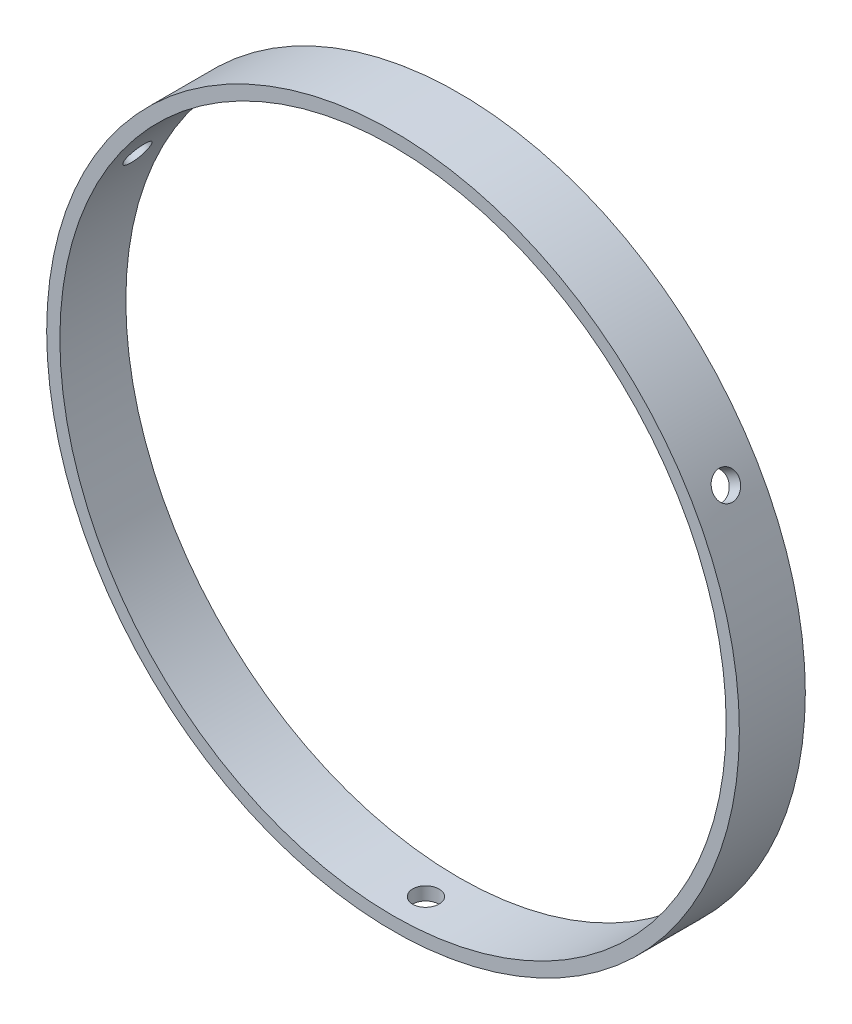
ISO-10303-21;
HEADER;
FILE_DESCRIPTION(('STEP AP214'),'2;1');
FILE_NAME('part.step','',(''),(''),'','','');
FILE_SCHEMA(('AUTOMOTIVE_DESIGN { 1 0 10303 214 1 1 1 1 }'));
ENDSEC;
DATA;
#1=APPLICATION_CONTEXT('core data for automotive mechanical design processes');
#2=APPLICATION_PROTOCOL_DEFINITION('international standard','automotive_design',2000,#1);
#3=PRODUCT_CONTEXT('',#1,'mechanical');
#4=PRODUCT('Part','Part','',(#3));
#5=PRODUCT_RELATED_PRODUCT_CATEGORY('part','',(#4));
#6=PRODUCT_DEFINITION_FORMATION('','',#4);
#7=PRODUCT_DEFINITION_CONTEXT('part definition',#1,'design');
#8=PRODUCT_DEFINITION('design','',#6,#7);
#9=PRODUCT_DEFINITION_SHAPE('','',#8);
#10=(LENGTH_UNIT() NAMED_UNIT(*) SI_UNIT(.MILLI.,.METRE.));
#11=(NAMED_UNIT(*) PLANE_ANGLE_UNIT() SI_UNIT($,.RADIAN.));
#12=(NAMED_UNIT(*) SI_UNIT($,.STERADIAN.) SOLID_ANGLE_UNIT());
#13=UNCERTAINTY_MEASURE_WITH_UNIT(LENGTH_MEASURE(1.E-05),#10,'distance_accuracy_value','');
#14=(GEOMETRIC_REPRESENTATION_CONTEXT(3) GLOBAL_UNCERTAINTY_ASSIGNED_CONTEXT((#13)) GLOBAL_UNIT_ASSIGNED_CONTEXT((#10,
#11,#12)) REPRESENTATION_CONTEXT('',''));
#15=CARTESIAN_POINT('',(0.,0.,0.));
#16=DIRECTION('',(0.,0.,1.));
#17=DIRECTION('',(1.,0.,0.));
#18=AXIS2_PLACEMENT_3D('',#15,#16,#17);
#19=CARTESIAN_POINT('',(0.,0.,5.));
#20=DIRECTION('',(0.,0.,1.));
#21=DIRECTION('',(1.,0.,0.));
#22=AXIS2_PLACEMENT_3D('',#19,#20,#21);
#23=PLANE('',#22);
#24=CARTESIAN_POINT('',(0.,0.,5.));
#25=DIRECTION('',(0.,0.,1.));
#26=DIRECTION('',(1.,0.,0.));
#27=AXIS2_PLACEMENT_3D('',#24,#25,#26);
#28=CIRCLE('',#27,52.5);
#29=CARTESIAN_POINT('',(52.5,0.,5.));
#30=VERTEX_POINT('',#29);
#31=EDGE_CURVE('E10',#30,#30,#28,.T.);
#32=ORIENTED_EDGE('',*,*,#31,.T.);
#33=EDGE_LOOP('',(#32));
#34=FACE_BOUND('',#33,.T.);
#35=CARTESIAN_POINT('',(0.,0.,5.));
#36=DIRECTION('',(0.,0.,1.));
#37=DIRECTION('',(1.,0.,0.));
#38=AXIS2_PLACEMENT_3D('',#35,#36,#37);
#39=CIRCLE('',#38,50.5);
#40=CARTESIAN_POINT('',(50.5,0.,5.));
#41=VERTEX_POINT('',#40);
#42=EDGE_CURVE('E49',#41,#41,#39,.T.);
#43=ORIENTED_EDGE('',*,*,#42,.F.);
#44=EDGE_LOOP('',(#43));
#45=FACE_BOUND('',#44,.T.);
#46=ADVANCED_FACE('F31',(#34,#45),#23,.T.);
#47=CARTESIAN_POINT('',(0.,0.,-5.));
#48=DIRECTION('',(0.,0.,1.));
#49=DIRECTION('',(1.,0.,0.));
#50=AXIS2_PLACEMENT_3D('',#47,#48,#49);
#51=PLANE('',#50);
#52=CARTESIAN_POINT('',(0.,0.,-5.));
#53=DIRECTION('',(0.,0.,1.));
#54=DIRECTION('',(1.,0.,0.));
#55=AXIS2_PLACEMENT_3D('',#52,#53,#54);
#56=CIRCLE('',#55,52.5);
#57=CARTESIAN_POINT('',(52.5,0.,-5.));
#58=VERTEX_POINT('',#57);
#59=EDGE_CURVE('E44',#58,#58,#56,.T.);
#60=ORIENTED_EDGE('',*,*,#59,.F.);
#61=EDGE_LOOP('',(#60));
#62=FACE_BOUND('',#61,.T.);
#63=CARTESIAN_POINT('',(0.,0.,-5.));
#64=DIRECTION('',(0.,0.,1.));
#65=DIRECTION('',(1.,0.,0.));
#66=AXIS2_PLACEMENT_3D('',#63,#64,#65);
#67=CIRCLE('',#66,50.5);
#68=CARTESIAN_POINT('',(50.5,0.,-5.));
#69=VERTEX_POINT('',#68);
#70=EDGE_CURVE('E52',#69,#69,#67,.T.);
#71=ORIENTED_EDGE('',*,*,#70,.T.);
#72=EDGE_LOOP('',(#71));
#73=FACE_BOUND('',#72,.T.);
#74=ADVANCED_FACE('F91',(#62,#73),#51,.F.);
#75=CARTESIAN_POINT('',(0.,0.,5.));
#76=DIRECTION('',(0.,0.,-1.));
#77=DIRECTION('',(-1.,0.,0.));
#78=AXIS2_PLACEMENT_3D('',#75,#76,#77);
#79=CYLINDRICAL_SURFACE('',#78,52.5);
#80=CARTESIAN_POINT('',(-44.433330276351,27.9629962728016,0.));
#81=CARTESIAN_POINT('',(-44.4333332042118,27.9629922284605,0.112297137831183));
#82=CARTESIAN_POINT('',(-44.4383907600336,27.954960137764,0.224674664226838));
#83=CARTESIAN_POINT('',(-44.4584693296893,27.9230164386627,0.446331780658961));
#84=CARTESIAN_POINT('',(-44.473502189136,27.8990859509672,0.555607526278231));
#85=CARTESIAN_POINT('',(-44.5130239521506,27.8359852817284,0.767817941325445));
#86=CARTESIAN_POINT('',(-44.5375081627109,27.7968226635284,0.870755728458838));
#87=CARTESIAN_POINT('',(-44.5951123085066,27.7043121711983,1.06739335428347));
#88=CARTESIAN_POINT('',(-44.6282301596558,27.6509677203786,1.16109541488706));
#89=CARTESIAN_POINT('',(-44.7020393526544,27.5314837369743,1.33669093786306));
#90=CARTESIAN_POINT('',(-44.7427349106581,27.4653370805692,1.41857778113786));
#91=CARTESIAN_POINT('',(-44.8303773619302,27.322047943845,1.56816232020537));
#92=CARTESIAN_POINT('',(-44.8773245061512,27.2449050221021,1.63585944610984));
#93=CARTESIAN_POINT('',(-44.9760006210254,27.0816995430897,1.75515743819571));
#94=CARTESIAN_POINT('',(-45.0277309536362,26.9956344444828,1.80675370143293));
#95=CARTESIAN_POINT('',(-45.1343650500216,26.8169704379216,1.89235563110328));
#96=CARTESIAN_POINT('',(-45.189268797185,26.7243715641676,1.92636138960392));
#97=CARTESIAN_POINT('',(-45.3005716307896,26.5352639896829,1.97580104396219));
#98=CARTESIAN_POINT('',(-45.3569699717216,26.4387572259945,1.99124402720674));
#99=CARTESIAN_POINT('',(-45.4696422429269,26.244508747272,2.00314778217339));
#100=CARTESIAN_POINT('',(-45.5259161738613,26.1467670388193,1.99960865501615));
#101=CARTESIAN_POINT('',(-45.6367216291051,25.952882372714,1.97365625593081));
#102=CARTESIAN_POINT('',(-45.6912540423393,25.8567386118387,1.95125277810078));
#103=CARTESIAN_POINT('',(-45.7971217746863,25.6687608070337,1.88822279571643));
#104=CARTESIAN_POINT('',(-45.8484570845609,25.5769267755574,1.84759623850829));
#105=CARTESIAN_POINT('',(-45.9465951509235,25.4002091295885,1.74926212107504));
#106=CARTESIAN_POINT('',(-45.9933967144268,25.3153273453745,1.69155008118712));
#107=CARTESIAN_POINT('',(-46.0812662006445,25.1550248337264,1.5606865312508));
#108=CARTESIAN_POINT('',(-46.1223341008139,25.0796041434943,1.4875349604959));
#109=CARTESIAN_POINT('',(-46.1977541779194,24.9404048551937,1.32781344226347));
#110=CARTESIAN_POINT('',(-46.2321020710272,24.8766336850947,1.24123499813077));
#111=CARTESIAN_POINT('',(-46.2932315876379,24.7626917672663,1.05714730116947));
#112=CARTESIAN_POINT('',(-46.3200132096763,24.7125210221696,0.959638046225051));
#113=CARTESIAN_POINT('',(-46.3653878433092,24.6272847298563,0.756451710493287));
#114=CARTESIAN_POINT('',(-46.3839807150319,24.5922194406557,0.650774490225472));
#115=CARTESIAN_POINT('',(-46.4125520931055,24.5382547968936,0.43425425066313));
#116=CARTESIAN_POINT('',(-46.4225306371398,24.5193553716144,0.323411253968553));
#117=CARTESIAN_POINT('',(-46.4336443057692,24.4983024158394,0.099780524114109));
#118=CARTESIAN_POINT('',(-46.4347849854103,24.496138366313,-0.0130059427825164));
#119=CARTESIAN_POINT('',(-46.428211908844,24.5085941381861,-0.237387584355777));
#120=CARTESIAN_POINT('',(-46.4204981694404,24.5232139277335,-0.348982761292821));
#121=CARTESIAN_POINT('',(-46.3963938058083,24.568787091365,-0.567780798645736));
#122=CARTESIAN_POINT('',(-46.3800057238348,24.5997356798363,-0.674984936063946));
#123=CARTESIAN_POINT('',(-46.3389268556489,24.677029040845,-0.881997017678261));
#124=CARTESIAN_POINT('',(-46.3142360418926,24.7233738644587,-0.981804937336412));
#125=CARTESIAN_POINT('',(-46.2571075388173,24.8300957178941,-1.1712461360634));
#126=CARTESIAN_POINT('',(-46.2246659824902,24.8904797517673,-1.26087430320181));
#127=CARTESIAN_POINT('',(-46.1528091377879,25.0234671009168,-1.42736040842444));
#128=CARTESIAN_POINT('',(-46.1133938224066,25.096070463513,-1.50421829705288));
#129=CARTESIAN_POINT('',(-46.0285256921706,25.2513889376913,-1.6430219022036));
#130=CARTESIAN_POINT('',(-45.9830697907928,25.3341092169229,-1.70495994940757));
#131=CARTESIAN_POINT('',(-45.8872793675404,25.5072021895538,-1.81211325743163));
#132=CARTESIAN_POINT('',(-45.8369448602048,25.5975748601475,-1.85732856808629));
#133=CARTESIAN_POINT('',(-45.7327235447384,25.7833148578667,-1.92973945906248));
#134=CARTESIAN_POINT('',(-45.6788377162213,25.8786808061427,-1.95693998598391));
#135=CARTESIAN_POINT('',(-45.5689578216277,26.0716782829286,-1.99256539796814));
#136=CARTESIAN_POINT('',(-45.5129637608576,26.1693098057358,-2.00099033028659));
#137=CARTESIAN_POINT('',(-45.4004714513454,26.3639872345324,-1.99882484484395));
#138=CARTESIAN_POINT('',(-45.3439735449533,26.46103347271,-1.98824648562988));
#139=CARTESIAN_POINT('',(-45.2320719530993,26.6518649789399,-1.94839955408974));
#140=CARTESIAN_POINT('',(-45.1766682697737,26.745650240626,-1.91913094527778));
#141=CARTESIAN_POINT('',(-45.0686054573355,26.9273464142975,-1.8427364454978));
#142=CARTESIAN_POINT('',(-45.0159463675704,27.0152572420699,-1.79561029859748));
#143=CARTESIAN_POINT('',(-44.9149873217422,27.1827793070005,-1.68484139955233));
#144=CARTESIAN_POINT('',(-44.8666872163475,27.2623908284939,-1.62119921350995));
#145=CARTESIAN_POINT('',(-44.7759344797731,27.4111894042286,-1.47916472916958));
#146=CARTESIAN_POINT('',(-44.7334849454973,27.4803709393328,-1.40076467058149));
#147=CARTESIAN_POINT('',(-44.655814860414,27.6064067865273,-1.2314329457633));
#148=CARTESIAN_POINT('',(-44.620596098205,27.663258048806,-1.14049818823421));
#149=CARTESIAN_POINT('',(-44.5585290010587,27.7631223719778,-0.948630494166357));
#150=CARTESIAN_POINT('',(-44.5316870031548,27.8061249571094,-0.847690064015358));
#151=CARTESIAN_POINT('',(-44.4873257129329,27.8770446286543,-0.638806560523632));
#152=CARTESIAN_POINT('',(-44.4697953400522,27.9049796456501,-0.530871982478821));
#153=CARTESIAN_POINT('',(-44.4492755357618,27.9376468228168,-0.351882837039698));
#154=CARTESIAN_POINT('',(-44.4433047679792,27.9471415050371,-0.281989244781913));
#155=CARTESIAN_POINT('',(-44.4353312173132,27.9598175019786,-0.14140772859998));
#156=CARTESIAN_POINT('',(-44.4333284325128,27.9629988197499,-0.0707198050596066));
#157=CARTESIAN_POINT('',(-44.433330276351,27.9629962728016,0.));
#158=B_SPLINE_CURVE_WITH_KNOTS('',3,(#80,#81,#82,#83,#84,#85,#86,#87,#88,#89,#90,#91,#92,#93,
#94,#95,#96,#97,#98,#99,#100,#101,#102,#103,#104,#105,#106,#107,#108,#109,#110,#111,#112,#113,
#114,#115,#116,#117,#118,#119,#120,#121,#122,#123,#124,#125,#126,#127,#128,#129,#130,#131,#132,
#133,#134,#135,#136,#137,#138,#139,#140,#141,#142,#143,#144,#145,#146,#147,#148,#149,#150,#151,
#152,#153,#154,#155,#156,#157),.UNSPECIFIED.,.T.,.F.,(4,2,2,2,2,2,2,2,2,2,2,2,2,2,2,2,2,2,2,2,2,
2,2,2,2,2,2,2,2,2,2,2,2,2,2,2,2,2,4),(0.,0.336633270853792,0.673667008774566,1.01053360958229,
1.34731896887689,1.68429227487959,2.02127911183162,2.35836219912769,2.69544352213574,
3.03235976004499,3.36927420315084,3.70601383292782,4.04275443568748,4.37958340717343,
4.71641370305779,5.05345802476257,5.39050241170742,5.72755255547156,6.06460122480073,
6.40143802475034,6.73827418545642,7.07501168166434,7.41175029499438,7.74865726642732,
8.08556554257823,8.42264663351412,8.75972671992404,9.09671421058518,9.43370085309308,
9.77047373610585,10.1072472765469,10.4440256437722,10.780792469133,11.1177368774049,
11.4547645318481,11.7920465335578,12.1289262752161,12.3409232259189,12.5529200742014),.UNSPECIFIED.);
#159=CARTESIAN_POINT('',(-44.433330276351,27.9629962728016,0.));
#160=VERTEX_POINT('',#159);
#161=EDGE_CURVE('E61',#160,#160,#158,.T.);
#162=ORIENTED_EDGE('',*,*,#161,.T.);
#163=EDGE_LOOP('',(#162));
#164=FACE_BOUND('',#163,.T.);
#165=CARTESIAN_POINT('',(46.4333302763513,24.4988946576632,0.));
#166=CARTESIAN_POINT('',(46.4333282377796,24.4988992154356,0.112297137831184));
#167=CARTESIAN_POINT('',(46.4289010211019,24.5072952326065,0.22467466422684));
#168=CARTESIAN_POINT('',(46.4112762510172,24.5406556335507,0.446331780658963));
#169=CARTESIAN_POINT('',(46.3980682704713,24.5656397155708,0.555607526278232));
#170=CARTESIAN_POINT('',(46.3631823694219,24.6314169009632,0.767817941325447));
#171=CARTESIAN_POINT('',(46.3415086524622,24.6722021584,0.870755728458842));
#172=CARTESIAN_POINT('',(46.2901942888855,24.7683440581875,1.06739335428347));
#173=CARTESIAN_POINT('',(46.2605555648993,24.8236971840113,1.16109541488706));
#174=CARTESIAN_POINT('',(46.1939839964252,24.947359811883,1.33669093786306));
#175=CARTESIAN_POINT('',(46.1570470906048,25.015676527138,1.41857778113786));
#176=CARTESIAN_POINT('',(46.0767762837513,25.1632216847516,1.56816232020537));
#177=CARTESIAN_POINT('',(46.0334421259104,25.2424505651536,1.63585944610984));
#178=CARTESIAN_POINT('',(45.941440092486,25.4095093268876,1.75515743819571));
#179=CARTESIAN_POINT('',(45.8927706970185,25.4973416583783,1.80675370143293));
#180=CARTESIAN_POINT('',(45.7913601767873,25.6790214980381,1.89235563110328));
#181=CARTESIAN_POINT('',(45.7386190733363,25.7728689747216,1.92636138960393));
#182=CARTESIAN_POINT('',(45.6304985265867,25.9638138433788,1.9758010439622));
#183=CARTESIAN_POINT('',(45.5751203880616,26.0609096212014,1.99124402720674));
#184=CARTESIAN_POINT('',(45.463232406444,26.2556109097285,2.00314778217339));
#185=CARTESIAN_POINT('',(45.4067225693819,26.3532164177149,1.99960865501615));
#186=CARTESIAN_POINT('',(45.2942162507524,26.5461190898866,1.97365625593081));
#187=CARTESIAN_POINT('',(45.2382195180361,26.6414174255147,1.95125277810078));
#188=CARTESIAN_POINT('',(45.1283598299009,26.8270904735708,1.88822279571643));
#189=CARTESIAN_POINT('',(45.0744968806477,26.9174651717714,1.84759623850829));
#190=CARTESIAN_POINT('',(44.9705239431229,27.0908140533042,1.74926212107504));
#191=CARTESIAN_POINT('',(44.9204149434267,27.1737862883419,1.69155008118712));
#192=CARTESIAN_POINT('',(44.8255236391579,27.330034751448,1.5606865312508));
#193=CARTESIAN_POINT('',(44.7807413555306,27.4033109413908,1.4875349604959));
#194=CARTESIAN_POINT('',(44.6979012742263,27.5382262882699,1.32781344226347));
#195=CARTESIAN_POINT('',(44.6598477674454,27.5998580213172,1.24123499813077));
#196=CARTESIAN_POINT('',(44.5917359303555,27.7097686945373,1.05714730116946));
#197=CARTESIAN_POINT('',(44.5616776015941,27.7580476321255,0.959638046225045));
#198=CARTESIAN_POINT('',(44.5105481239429,27.8399613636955,0.75645171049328));
#199=CARTESIAN_POINT('',(44.4894771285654,27.873595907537,0.650774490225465));
#200=CARTESIAN_POINT('',(44.4570280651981,27.925321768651,0.434254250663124));
#201=CARTESIAN_POINT('',(44.4456499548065,27.943413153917,0.323411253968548));
#202=CARTESIAN_POINT('',(44.4329743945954,27.9635643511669,0.0997805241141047));
#203=CARTESIAN_POINT('',(44.431670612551,27.9656342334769,-0.0130059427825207));
#204=CARTESIAN_POINT('',(44.4391710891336,27.9537138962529,-0.237387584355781));
#205=CARTESIAN_POINT('',(44.4479753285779,27.9397237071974,-0.348982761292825));
#206=CARTESIAN_POINT('',(44.4753906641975,27.8960621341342,-0.567780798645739));
#207=CARTESIAN_POINT('',(44.4939988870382,27.8663953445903,-0.674984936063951));
#208=CARTESIAN_POINT('',(44.5403974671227,27.7921733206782,-0.881997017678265));
#209=CARTESIAN_POINT('',(44.5681878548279,27.7476180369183,-0.981804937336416));
#210=CARTESIAN_POINT('',(44.6320474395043,27.6447823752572,-1.17124613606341));
#211=CARTESIAN_POINT('',(44.6681207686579,27.586495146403,-1.26087430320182));
#212=CARTESIAN_POINT('',(44.7473627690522,27.4577716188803,-1.42736040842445));
#213=CARTESIAN_POINT('',(44.79053146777,27.3873352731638,-1.50421829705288));
#214=CARTESIAN_POINT('',(44.8826071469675,27.2361780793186,-1.6430219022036));
#215=CARTESIAN_POINT('',(44.9315170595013,27.1554519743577,-1.70495994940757));
#216=CARTESIAN_POINT('',(45.0335247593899,26.9859485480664,-1.81211325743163));
#217=CARTESIAN_POINT('',(45.0866225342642,26.8971712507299,-1.85732856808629));
#218=CARTESIAN_POINT('',(45.1953674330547,26.7140429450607,-1.92973945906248));
#219=CARTESIAN_POINT('',(45.2510138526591,26.6196934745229,-1.95693998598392));
#220=CARTESIAN_POINT('',(45.3632146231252,26.4280359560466,-1.99256539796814));
#221=CARTESIAN_POINT('',(45.4197689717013,26.3307279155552,-2.00099033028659));
#222=CARTESIAN_POINT('',(45.5321184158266,26.1359680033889,-1.99882484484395));
#223=CARTESIAN_POINT('',(45.587913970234,26.0385162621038,-1.98824648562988));
#224=CARTESIAN_POINT('',(45.6972281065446,25.8461908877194,-1.94839955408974));
#225=CARTESIAN_POINT('',(45.7507466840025,25.7513172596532,-1.91913094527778));
#226=CARTESIAN_POINT('',(45.8540687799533,25.5668840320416,-1.84273644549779));
#227=CARTESIAN_POINT('',(45.9038722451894,25.4773245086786,-1.79561029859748));
#228=CARTESIAN_POINT('',(45.9984710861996,25.3061303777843,-1.68484139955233));
#229=CARTESIAN_POINT('',(46.0432666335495,25.2244954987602,-1.62119921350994));
#230=CARTESIAN_POINT('',(46.1267536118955,25.0715020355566,-1.47916472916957));
#231=CARTESIAN_POINT('',(46.1654418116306,25.0001488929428,-1.40076467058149));
#232=CARTESIAN_POINT('',(46.2357570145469,24.8698667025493,-1.23143294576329));
#233=CARTESIAN_POINT('',(46.267382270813,24.8109407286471,-1.14049818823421));
#234=CARTESIAN_POINT('',(46.3228337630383,24.7072568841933,-0.948630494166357));
#235=CARTESIAN_POINT('',(46.3466540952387,24.6625097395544,-0.847690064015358));
#236=CARTESIAN_POINT('',(46.3858916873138,24.5886318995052,-0.63880656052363));
#237=CARTESIAN_POINT('',(46.4013189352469,24.5594826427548,-0.530871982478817));
#238=CARTESIAN_POINT('',(46.419349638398,24.5253783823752,-0.351882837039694));
#239=CARTESIAN_POINT('',(46.4245868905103,24.5154602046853,-0.281989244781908));
#240=CARTESIAN_POINT('',(46.431577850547,24.5022169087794,-0.141407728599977));
#241=CARTESIAN_POINT('',(46.4333315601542,24.4988917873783,-0.0707198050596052));
#242=CARTESIAN_POINT('',(46.4333302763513,24.4988946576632,0.));
#243=B_SPLINE_CURVE_WITH_KNOTS('',3,(#165,#166,#167,#168,#169,#170,#171,#172,#173,#174,#175,
#176,#177,#178,#179,#180,#181,#182,#183,#184,#185,#186,#187,#188,#189,#190,#191,#192,#193,#194,
#195,#196,#197,#198,#199,#200,#201,#202,#203,#204,#205,#206,#207,#208,#209,#210,#211,#212,#213,
#214,#215,#216,#217,#218,#219,#220,#221,#222,#223,#224,#225,#226,#227,#228,#229,#230,#231,#232,
#233,#234,#235,#236,#237,#238,#239,#240,#241,#242),.UNSPECIFIED.,.T.,.F.,(4,2,2,2,2,2,2,2,2,2,2,
2,2,2,2,2,2,2,2,2,2,2,2,2,2,2,2,2,2,2,2,2,2,2,2,2,2,2,4),(0.,0.336633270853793,
0.673667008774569,1.01053360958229,1.3473189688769,1.68429227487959,2.02127911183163,
2.3583621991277,2.69544352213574,3.032359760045,3.36927420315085,3.70601383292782,
4.04275443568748,4.37958340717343,4.7164137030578,5.05345802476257,5.39050241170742,
5.72755255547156,6.06460122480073,6.40143802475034,6.73827418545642,7.07501168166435,
7.41175029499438,7.74865726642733,8.08556554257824,8.42264663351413,8.75972671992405,
9.09671421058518,9.43370085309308,9.77047373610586,10.1072472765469,10.4440256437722,
10.780792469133,11.1177368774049,11.4547645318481,11.7920465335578,12.1289262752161,
12.3409232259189,12.5529200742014),.UNSPECIFIED.);
#244=CARTESIAN_POINT('',(46.4333302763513,24.4988946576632,0.));
#245=VERTEX_POINT('',#244);
#246=EDGE_CURVE('E146',#245,#245,#243,.T.);
#247=ORIENTED_EDGE('',*,*,#246,.T.);
#248=EDGE_LOOP('',(#247));
#249=FACE_BOUND('',#248,.T.);
#250=CARTESIAN_POINT('',(0.,-52.5,2.));
#251=CARTESIAN_POINT('',(0.112297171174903,-52.4999994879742,1.99999503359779));
#252=CARTESIAN_POINT('',(0.22467473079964,-52.499635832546,1.99051025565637));
#253=CARTESIAN_POINT('',(0.446331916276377,-52.4982200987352,1.95280689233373));
#254=CARTESIAN_POINT('',(0.555607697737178,-52.4971672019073,1.92456603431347));
#255=CARTESIAN_POINT('',(0.767818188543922,-52.494492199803,1.85015831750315));
#256=CARTESIAN_POINT('',(0.87075601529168,-52.4928703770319,1.8040003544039));
#257=CARTESIAN_POINT('',(1.06739370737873,-52.4892403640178,1.69508176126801));
#258=CARTESIAN_POINT('',(1.1610957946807,-52.4872322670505,1.63232513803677));
#259=CARTESIAN_POINT('',(1.3366912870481,-52.4830542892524,1.49194432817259));
#260=CARTESIAN_POINT('',(1.41857808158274,-52.4808843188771,1.4143118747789));
#261=CARTESIAN_POINT('',(1.56816252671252,-52.4766279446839,1.24639865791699));
#262=CARTESIAN_POINT('',(1.63585960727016,-52.4745415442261,1.15611738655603));
#263=CARTESIAN_POINT('',(1.75515755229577,-52.4706870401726,0.965439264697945));
#264=CARTESIAN_POINT('',(1.80675380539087,-52.4689190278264,0.865039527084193));
#265=CARTESIAN_POINT('',(1.89235571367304,-52.4659016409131,0.656994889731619));
#266=CARTESIAN_POINT('',(1.92636146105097,-52.4646522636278,0.549350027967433));
#267=CARTESIAN_POINT('',(1.97580109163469,-52.4628137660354,0.329926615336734));
#268=CARTESIAN_POINT('',(1.99124406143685,-52.4622243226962,0.218150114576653));
#269=CARTESIAN_POINT('',(2.00314778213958,-52.4617711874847,-0.00641017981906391));
#270=CARTESIAN_POINT('',(1.99960863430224,-52.4619074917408,-0.119193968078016));
#271=CARTESIAN_POINT('',(1.97365620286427,-52.46289018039,-0.342505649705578));
#272=CARTESIAN_POINT('',(1.95125273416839,-52.4637361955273,-0.453034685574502));
#273=CARTESIAN_POINT('',(1.8882228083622,-52.4660423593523,-0.668761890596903));
#274=CARTESIAN_POINT('',(1.8475962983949,-52.4675025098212,-0.77396004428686));
#275=CARTESIAN_POINT('',(1.74926227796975,-52.470872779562,-0.976070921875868));
#276=CARTESIAN_POINT('',(1.69155027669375,-52.4727830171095,-1.07298145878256));
#277=CARTESIAN_POINT('',(1.56068680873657,-52.4768380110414,-1.25574221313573));
#278=CARTESIAN_POINT('',(1.48753528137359,-52.4789827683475,-1.34159238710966));
#279=CARTESIAN_POINT('',(1.32781379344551,-52.4832666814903,-1.49985259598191));
#280=CARTESIAN_POINT('',(1.24123532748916,-52.4854058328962,-1.57225404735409));
#281=CARTESIAN_POINT('',(1.0571475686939,-52.489436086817,-1.7014954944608));
#282=CARTESIAN_POINT('',(0.959638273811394,-52.4913271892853,-1.75833548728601));
#283=CARTESIAN_POINT('',(0.756451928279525,-52.4946482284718,-1.85483962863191));
#284=CARTESIAN_POINT('',(0.650774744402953,-52.4960781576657,-1.89450349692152));
#285=CARTESIAN_POINT('',(0.434254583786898,-52.4983155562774,-1.95552395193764));
#286=CARTESIAN_POINT('',(0.323411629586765,-52.4991230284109,-1.97688061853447));
#287=CARTESIAN_POINT('',(0.0997809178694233,-52.500024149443,-2.00066989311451));
#288=CARTESIAN_POINT('',(-0.0130055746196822,-52.5001182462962,-2.00311437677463));
#289=CARTESIAN_POINT('',(-0.237387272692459,-52.4995831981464,-1.98904085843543));
#290=CARTESIAN_POINT('',(-0.348982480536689,-52.4989540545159,-1.97252289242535));
#291=CARTESIAN_POINT('',(-0.567780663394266,-52.4970437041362,-1.92100318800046));
#292=CARTESIAN_POINT('',(-0.674984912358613,-52.4957626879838,-1.88600685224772));
#293=CARTESIAN_POINT('',(-0.881997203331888,-52.4926928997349,-1.79852930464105));
#294=CARTESIAN_POINT('',(-0.981805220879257,-52.4909041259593,-1.74604803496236));
#295=CARTESIAN_POINT('',(-1.17124648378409,-52.4870191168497,-1.62505984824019));
#296=CARTESIAN_POINT('',(-1.26087462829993,-52.484922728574,-1.55654494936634));
#297=CARTESIAN_POINT('',(-1.42736068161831,-52.4806592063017,-1.40544609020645));
#298=CARTESIAN_POINT('',(-1.50421854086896,-52.4784920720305,-1.32286207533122));
#299=CARTESIAN_POINT('',(-1.64302208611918,-52.4743300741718,-1.14591827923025));
#300=CARTESIAN_POINT('',(-1.70496010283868,-52.4723352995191,-1.0515524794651));
#301=CARTESIAN_POINT('',(-1.81211335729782,-52.4687443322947,-0.853754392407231));
#302=CARTESIAN_POINT('',(-1.85732864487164,-52.4671481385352,-0.750322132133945));
#303=CARTESIAN_POINT('',(-1.92973951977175,-52.4645349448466,-0.537355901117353));
#304=CARTESIAN_POINT('',(-1.95694004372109,-52.463517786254,-0.427823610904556));
#305=CARTESIAN_POINT('',(-1.99256543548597,-52.4621769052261,-0.205742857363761));
#306=CARTESIAN_POINT('',(-2.00099035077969,-52.4618531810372,-0.0931944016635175));
#307=CARTESIAN_POINT('',(-1.99882481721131,-52.4619357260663,0.13164731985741));
#308=CARTESIAN_POINT('',(-1.98824644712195,-52.4623415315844,0.243940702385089));
#309=CARTESIAN_POINT('',(-1.94839952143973,-52.46383641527,0.465156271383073));
#310=CARTESIAN_POINT('',(-1.91913092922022,-52.4649254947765,0.574078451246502));
#311=CARTESIAN_POINT('',(-1.84273649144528,-52.4676640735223,0.785463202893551));
#312=CARTESIAN_POINT('',(-1.79561038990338,-52.4693135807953,0.887925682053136));
#313=CARTESIAN_POINT('',(-1.68484160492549,-52.4729870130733,1.08348343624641));
#314=CARTESIAN_POINT('',(-1.62119948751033,-52.4750109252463,1.17657903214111));
#315=CARTESIAN_POINT('',(-1.47916507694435,-52.4792064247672,1.35081875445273));
#316=CARTESIAN_POINT('',(-1.40076500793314,-52.4813780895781,1.43195654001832));
#317=CARTESIAN_POINT('',(-1.23143324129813,-52.4856240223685,1.57994192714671));
#318=CARTESIAN_POINT('',(-1.14049845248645,-52.4876982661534,1.64678599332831));
#319=CARTESIAN_POINT('',(-0.948630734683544,-52.4915165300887,1.76430463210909));
#320=CARTESIAN_POINT('',(-0.847690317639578,-52.4932603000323,1.81496697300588));
#321=CARTESIAN_POINT('',(-0.638806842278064,-52.49621691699,1.89856587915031));
#322=CARTESIAN_POINT('',(-0.530872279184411,-52.4974303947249,1.93152351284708));
#323=CARTESIAN_POINT('',(-0.351883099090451,-52.4988665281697,1.9700740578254));
#324=CARTESIAN_POINT('',(-0.281989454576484,-52.4992897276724,1.98128209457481));
#325=CARTESIAN_POINT('',(-0.141407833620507,-52.4998566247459,1.99624662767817));
#326=CARTESIAN_POINT('',(-0.0707198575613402,-52.5000003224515,2.00000312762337));
#327=CARTESIAN_POINT('',(0.,-52.5,2.));
#328=B_SPLINE_CURVE_WITH_KNOTS('',3,(#250,#251,#252,#253,#254,#255,#256,#257,#258,#259,#260,
#261,#262,#263,#264,#265,#266,#267,#268,#269,#270,#271,#272,#273,#274,#275,#276,#277,#278,#279,
#280,#281,#282,#283,#284,#285,#286,#287,#288,#289,#290,#291,#292,#293,#294,#295,#296,#297,#298,
#299,#300,#301,#302,#303,#304,#305,#306,#307,#308,#309,#310,#311,#312,#313,#314,#315,#316,#317,
#318,#319,#320,#321,#322,#323,#324,#325,#326,#327),.UNSPECIFIED.,.T.,.F.,(4,2,2,2,2,2,2,2,2,2,2,
2,2,2,2,2,2,2,2,2,2,2,2,2,2,2,2,2,2,2,2,2,2,2,2,2,2,2,4),(0.,0.336633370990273,
0.673667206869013,1.01053392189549,1.34731939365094,1.68429256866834,2.02127927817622,
2.35836241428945,2.69544378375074,3.03236008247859,3.36927458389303,3.70601390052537,
4.04275419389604,4.3795830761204,4.71641328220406,5.05345773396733,5.3905022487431,
5.72755226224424,6.06460080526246,6.40143768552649,6.73827392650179,7.07501173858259,
7.41175066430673,7.74865758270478,8.08556580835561,8.42264684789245,8.75972688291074,
9.09671450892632,9.43370128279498,9.77047393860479,10.1072472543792,10.4440253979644,
10.7807920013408,11.1177365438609,11.4547643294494,11.792046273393,12.1289259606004,
12.340923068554,12.5529200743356),.UNSPECIFIED.);
#329=CARTESIAN_POINT('',(0.,-52.5,2.));
#330=VERTEX_POINT('',#329);
#331=EDGE_CURVE('E60',#330,#330,#328,.T.);
#332=ORIENTED_EDGE('',*,*,#331,.T.);
#333=EDGE_LOOP('',(#332));
#334=FACE_BOUND('',#333,.T.);
#335=ORIENTED_EDGE('',*,*,#31,.F.);
#336=EDGE_LOOP('',(#335));
#337=FACE_BOUND('',#336,.T.);
#338=ORIENTED_EDGE('',*,*,#59,.T.);
#339=EDGE_LOOP('',(#338));
#340=FACE_BOUND('',#339,.T.);
#341=ADVANCED_FACE('F33',(#164,#249,#334,#337,#340),#79,.T.);
#342=CARTESIAN_POINT('',(0.,0.,5.));
#343=DIRECTION('',(0.,0.,-1.));
#344=DIRECTION('',(-1.,0.,0.));
#345=AXIS2_PLACEMENT_3D('',#342,#343,#344);
#346=CYLINDRICAL_SURFACE('',#345,50.5);
#347=CARTESIAN_POINT('',(-42.6999713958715,26.9622410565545,0.));
#348=CARTESIAN_POINT('',(-42.6999743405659,26.9622370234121,0.112293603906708));
#349=CARTESIAN_POINT('',(-42.7050440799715,26.9542126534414,0.224667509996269));
#350=CARTESIAN_POINT('',(-42.7251699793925,26.9222991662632,0.446317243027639));
#351=CARTESIAN_POINT('',(-42.7402380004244,26.8983912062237,0.555589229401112));
#352=CARTESIAN_POINT('',(-42.7798488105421,26.8353482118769,0.767792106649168));
#353=CARTESIAN_POINT('',(-42.8043868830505,26.7962207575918,0.870726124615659));
#354=CARTESIAN_POINT('',(-42.8621111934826,26.7037895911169,1.06735695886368));
#355=CARTESIAN_POINT('',(-42.8952953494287,26.6504892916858,1.16105599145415));
#356=CARTESIAN_POINT('',(-42.969243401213,26.531095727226,1.33665003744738));
#357=CARTESIAN_POINT('',(-43.0100117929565,26.4649948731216,1.41853799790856));
#358=CARTESIAN_POINT('',(-43.0977971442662,26.3217955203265,1.56812558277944));
#359=CARTESIAN_POINT('',(-43.1448143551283,26.2446965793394,1.63582463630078));
#360=CARTESIAN_POINT('',(-43.2436212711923,26.0815701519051,1.75512882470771));
#361=CARTESIAN_POINT('',(-43.2954124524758,25.9955399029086,1.80672896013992));
#362=CARTESIAN_POINT('',(-43.4021511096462,25.8169341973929,1.89233833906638));
#363=CARTESIAN_POINT('',(-43.4570985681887,25.72435877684,1.92634767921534));
#364=CARTESIAN_POINT('',(-43.5684645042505,25.5352878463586,1.97579279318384));
#365=CARTESIAN_POINT('',(-43.6248821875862,25.4387944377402,1.99123839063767));
#366=CARTESIAN_POINT('',(-43.7375685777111,25.2445578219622,2.00314787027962));
#367=CARTESIAN_POINT('',(-43.7938372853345,25.1468146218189,1.99961185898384));
#368=CARTESIAN_POINT('',(-43.904605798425,24.9529167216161,1.97366670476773));
#369=CARTESIAN_POINT('',(-43.959106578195,24.8567611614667,1.95126814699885));
#370=CARTESIAN_POINT('',(-44.0648904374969,24.6687469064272,1.88825010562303));
#371=CARTESIAN_POINT('',(-44.1161735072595,24.5768882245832,1.84763056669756));
#372=CARTESIAN_POINT('',(-44.2141933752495,24.4001092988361,1.74931148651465));
#373=CARTESIAN_POINT('',(-44.2609288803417,24.3151910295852,1.69160710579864));
#374=CARTESIAN_POINT('',(-44.3486589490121,24.1548094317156,1.56075991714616));
#375=CARTESIAN_POINT('',(-44.3896534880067,24.0793461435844,1.48761704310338));
#376=CARTESIAN_POINT('',(-44.4649299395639,23.9400562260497,1.32790924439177));
#377=CARTESIAN_POINT('',(-44.4992072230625,23.8762376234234,1.24133513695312));
#378=CARTESIAN_POINT('',(-44.5602043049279,23.7622050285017,1.05725472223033));
#379=CARTESIAN_POINT('',(-44.5869241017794,23.7119910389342,0.959748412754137));
#380=CARTESIAN_POINT('',(-44.6321911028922,23.6266768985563,0.756566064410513));
#381=CARTESIAN_POINT('',(-44.6507381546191,23.5915770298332,0.650889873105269));
#382=CARTESIAN_POINT('',(-44.6792391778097,23.5375556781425,0.434369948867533));
#383=CARTESIAN_POINT('',(-44.6891931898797,23.5186341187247,0.323526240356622));
#384=CARTESIAN_POINT('',(-44.7002817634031,23.4975521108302,0.0998983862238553));
#385=CARTESIAN_POINT('',(-44.701422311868,23.4953802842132,-0.0128843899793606));
#386=CARTESIAN_POINT('',(-44.6948743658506,23.507833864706,-0.237259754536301));
#387=CARTESIAN_POINT('',(-44.6871858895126,23.522459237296,-0.348852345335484));
#388=CARTESIAN_POINT('',(-44.6631552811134,23.5680550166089,-0.567643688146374));
#389=CARTESIAN_POINT('',(-44.6468158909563,23.59902024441,-0.674843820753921));
#390=CARTESIAN_POINT('',(-44.6058527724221,23.6763553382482,-0.881849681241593));
#391=CARTESIAN_POINT('',(-44.5812290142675,23.7227252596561,-0.98165538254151));
#392=CARTESIAN_POINT('',(-44.5242448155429,23.8295042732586,-1.17109841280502));
#393=CARTESIAN_POINT('',(-44.4918802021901,23.8899209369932,-1.2607302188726));
#394=CARTESIAN_POINT('',(-44.4201796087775,24.0229752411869,-1.4272256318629));
#395=CARTESIAN_POINT('',(-44.3808435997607,24.0956129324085,-1.50408918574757));
#396=CARTESIAN_POINT('',(-44.2961260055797,24.251000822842,-1.64290922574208));
#397=CARTESIAN_POINT('',(-44.2507410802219,24.3337566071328,-1.70485742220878));
#398=CARTESIAN_POINT('',(-44.1550778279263,24.506914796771,-1.81203160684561));
#399=CARTESIAN_POINT('',(-44.104799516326,24.5973171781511,-1.85725764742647));
#400=CARTESIAN_POINT('',(-44.0006706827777,24.7831052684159,-1.92968918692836));
#401=CARTESIAN_POINT('',(-43.9468212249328,24.8784894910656,-1.95690002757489));
#402=CARTESIAN_POINT('',(-43.8369892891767,25.0715116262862,-1.99254625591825));
#403=CARTESIAN_POINT('',(-43.7810068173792,25.1691495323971,-2.00098169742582));
#404=CARTESIAN_POINT('',(-43.6685146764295,25.3638217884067,-1.99883707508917));
#405=CARTESIAN_POINT('',(-43.612005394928,25.4608565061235,-1.98827004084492));
#406=CARTESIAN_POINT('',(-43.5000567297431,25.6516530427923,-1.94844729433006));
#407=CARTESIAN_POINT('',(-43.4446173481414,25.7454148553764,-1.91919154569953));
#408=CARTESIAN_POINT('',(-43.336462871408,25.9270547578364,-1.8428241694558));
#409=CARTESIAN_POINT('',(-43.2837478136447,26.0149327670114,-1.79571229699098));
#410=CARTESIAN_POINT('',(-43.1826625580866,26.1823839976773,-1.6849730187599));
#411=CARTESIAN_POINT('',(-43.1342922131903,26.2619575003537,-1.62134617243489));
#412=CARTESIAN_POINT('',(-43.0433898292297,26.410683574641,-1.47933917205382));
#413=CARTESIAN_POINT('',(-43.0008611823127,26.4798300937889,-1.40095050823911));
#414=CARTESIAN_POINT('',(-42.923034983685,26.6057994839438,-1.23163989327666));
#415=CARTESIAN_POINT('',(-42.8877392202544,26.6626193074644,-1.14071485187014));
#416=CARTESIAN_POINT('',(-42.8255276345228,26.7624299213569,-0.948862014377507));
#417=CARTESIAN_POINT('',(-42.7986183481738,26.805409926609,-0.847926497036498));
#418=CARTESIAN_POINT('',(-42.7541403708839,26.8762952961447,-0.639049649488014));
#419=CARTESIAN_POINT('',(-42.7365605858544,26.9042185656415,-0.531116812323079));
#420=CARTESIAN_POINT('',(-42.7159744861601,26.9368841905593,-0.352089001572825));
#421=CARTESIAN_POINT('',(-42.7099821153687,26.9463816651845,-0.282155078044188));
#422=CARTESIAN_POINT('',(-42.7019796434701,26.9590613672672,-0.141491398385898));
#423=CARTESIAN_POINT('',(-42.6999695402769,26.962243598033,-0.0707616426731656));
#424=CARTESIAN_POINT('',(-42.6999713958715,26.9622410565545,0.));
#425=B_SPLINE_CURVE_WITH_KNOTS('',3,(#347,#348,#349,#350,#351,#352,#353,#354,#355,#356,#357,
#358,#359,#360,#361,#362,#363,#364,#365,#366,#367,#368,#369,#370,#371,#372,#373,#374,#375,#376,
#377,#378,#379,#380,#381,#382,#383,#384,#385,#386,#387,#388,#389,#390,#391,#392,#393,#394,#395,
#396,#397,#398,#399,#400,#401,#402,#403,#404,#405,#406,#407,#408,#409,#410,#411,#412,#413,#414,
#415,#416,#417,#418,#419,#420,#421,#422,#423,#424),.UNSPECIFIED.,.T.,.F.,(4,2,2,2,2,2,2,2,2,2,2,
2,2,2,2,2,2,2,2,2,2,2,2,2,2,2,2,2,2,2,2,2,2,2,2,2,2,2,4),(0.,0.336622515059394,
0.673645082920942,1.01050001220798,1.34727390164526,1.68424806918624,2.02123579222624,
2.35832806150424,2.69541847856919,3.03233043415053,3.36924049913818,3.70596162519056,
4.04268377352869,4.37950139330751,4.7163204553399,5.05337081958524,5.3904212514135,
5.72747797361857,6.06453310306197,6.40135924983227,6.73818470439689,7.07490346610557,
7.41162343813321,7.74852533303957,8.08542862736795,8.42251873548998,8.75960778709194,
9.09659684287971,9.43358493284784,9.77034204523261,10.107099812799,10.4438621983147,
10.7806131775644,11.1175588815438,11.4545877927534,11.791878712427,12.1287676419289,
12.3408899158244,12.5530120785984),.UNSPECIFIED.);
#426=CARTESIAN_POINT('',(-42.6999713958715,26.9622410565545,0.));
#427=VERTEX_POINT('',#426);
#428=EDGE_CURVE('E36',#427,#427,#425,.T.);
#429=ORIENTED_EDGE('',*,*,#428,.F.);
#430=EDGE_LOOP('',(#429));
#431=FACE_BOUND('',#430,.T.);
#432=CARTESIAN_POINT('',(44.6999713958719,23.4981394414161,0.));
#433=CARTESIAN_POINT('',(44.6999693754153,23.4981440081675,0.112293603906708));
#434=CARTESIAN_POINT('',(44.6955549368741,23.5065467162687,0.224667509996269));
#435=CARTESIAN_POINT('',(44.6779799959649,23.5399330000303,0.446317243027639));
#436=CARTESIAN_POINT('',(44.664809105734,23.5649362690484,0.555589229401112));
#437=CARTESIAN_POINT('',(44.6300176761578,23.6307617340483,0.767792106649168));
#438=CARTESIAN_POINT('',(44.6084013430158,23.671576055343,0.870726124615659));
#439=CARTESIAN_POINT('',(44.5572157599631,23.7677823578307,1.06735695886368));
#440=CARTESIAN_POINT('',(44.5276484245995,23.8231708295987,1.16105599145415));
#441=CARTESIAN_POINT('',(44.4612245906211,23.9469085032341,1.33665003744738));
#442=CARTESIAN_POINT('',(44.4243637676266,24.0152653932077,1.41853799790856));
#443=CARTESIAN_POINT('',(44.3442421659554,24.1628894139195,1.56812558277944));
#444=CARTESIAN_POINT('',(44.3009811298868,24.2421569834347,1.63582463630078));
#445=CARTESIAN_POINT('',(44.209112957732,24.4092894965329,1.75512882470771));
#446=CARTESIAN_POINT('',(44.1605041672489,24.4971570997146,1.80672896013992));
#447=CARTESIAN_POINT('',(44.0591964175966,24.6788983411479,1.89233833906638));
#448=CARTESIAN_POINT('',(44.0064974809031,24.7727719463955,1.92634767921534));
#449=CARTESIAN_POINT('',(43.8984402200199,24.9637531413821,1.97579279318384));
#450=CARTESIAN_POINT('',(43.8430833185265,25.0608589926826,1.99123839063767));
#451=CARTESIAN_POINT('',(43.7312126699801,25.2555665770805,2.00314787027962));
#452=CARTESIAN_POINT('',(43.6746989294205,25.3531683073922,1.99961185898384));
#453=CARTESIAN_POINT('',(43.5621626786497,25.5460456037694,1.97366670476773));
#454=CARTESIAN_POINT('',(43.5061399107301,25.6413224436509,1.95126814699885));
#455=CARTESIAN_POINT('',(43.3962067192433,25.8269410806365,1.88825010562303));
#456=CARTESIAN_POINT('',(43.3422963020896,25.9172828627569,1.84763056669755));
#457=CARTESIAN_POINT('',(43.2382111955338,26.0905600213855,1.74931148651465));
#458=CARTESIAN_POINT('',(43.1880375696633,26.1734932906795,1.69160710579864));
#459=CARTESIAN_POINT('',(43.0930080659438,26.3296605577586,1.56075991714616));
#460=CARTESIAN_POINT('',(43.0481522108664,26.40289451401,1.48761704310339));
#461=CARTESIAN_POINT('',(42.9651618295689,26.5377307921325,1.32790924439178));
#462=CARTESIAN_POINT('',(42.9270319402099,26.5993250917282,1.24133513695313));
#463=CARTESIAN_POINT('',(42.8587753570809,26.7091664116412,1.05725472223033));
#464=CARTESIAN_POINT('',(42.8286486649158,26.7574134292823,0.959748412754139));
#465=CARTESIAN_POINT('',(42.7773979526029,26.8392728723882,0.756566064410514));
#466=CARTESIAN_POINT('',(42.7562741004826,26.8728850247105,0.650889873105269));
#467=CARTESIAN_POINT('',(42.723740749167,26.9245783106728,0.434369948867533));
#468=CARTESIAN_POINT('',(42.712331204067,26.9426595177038,0.323526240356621));
#469=CARTESIAN_POINT('',(42.6996179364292,26.9628035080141,0.0998983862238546));
#470=CARTESIAN_POINT('',(42.6983073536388,26.9648771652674,-0.0128843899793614));
#471=CARTESIAN_POINT('',(42.7058184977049,26.9529796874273,-0.237259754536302));
#472=CARTESIAN_POINT('',(42.7146402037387,26.9390085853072,-0.348852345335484));
#473=CARTESIAN_POINT('',(42.7421120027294,26.8953995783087,-0.567643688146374));
#474=CARTESIAN_POINT('',(42.7607589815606,26.8657666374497,-0.674843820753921));
#475=CARTESIAN_POINT('',(42.8072515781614,26.7916239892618,-0.881849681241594));
#476=CARTESIAN_POINT('',(42.8350972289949,26.7471142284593,-0.981655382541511));
#477=CARTESIAN_POINT('',(42.8990784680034,26.6443749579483,-1.17109841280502));
#478=CARTESIAN_POINT('',(42.935218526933,26.5861380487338,-1.2607302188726));
#479=CARTESIAN_POINT('',(43.0145966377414,26.4575163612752,-1.4272256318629));
#480=CARTESIAN_POINT('',(43.0578347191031,26.3871315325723,-1.50408918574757));
#481=CARTESIAN_POINT('',(43.1500457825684,26.2360699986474,-1.64290922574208));
#482=CARTESIAN_POINT('',(43.1990219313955,26.1553876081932,-1.70485742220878));
#483=CARTESIAN_POINT('',(43.3011496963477,25.9859617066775,-1.8120316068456));
#484=CARTESIAN_POINT('',(43.3543012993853,25.8972182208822,-1.85725764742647));
#485=CARTESIAN_POINT('',(43.4631340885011,25.7141459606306,-1.92968918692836));
#486=CARTESIAN_POINT('',(43.5188145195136,25.619818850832,-1.95690002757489));
#487=CARTESIAN_POINT('',(43.6310606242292,25.4281905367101,-1.99254625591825));
#488=CARTESIAN_POINT('',(43.6876262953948,25.3308893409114,-2.00098169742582));
#489=CARTESIAN_POINT('',(43.7999713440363,25.136132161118,-1.99883707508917));
#490=CARTESIAN_POINT('',(43.8557512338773,25.0386763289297,-1.98827004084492));
#491=CARTESIAN_POINT('',(43.9650115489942,24.8463276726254,-1.94844729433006));
#492=CARTESIAN_POINT('',(44.0184919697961,24.7514348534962,-1.91919154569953));
#493=CARTESIAN_POINT('',(44.1217195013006,24.566950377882,-1.8428241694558));
#494=CARTESIAN_POINT('',(44.1714665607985,24.4773587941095,-1.79571229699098));
#495=CARTESIAN_POINT('',(44.2659409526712,24.3060907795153,-1.6849730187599));
#496=CARTESIAN_POINT('',(44.3106684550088,24.2244140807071,-1.62134617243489));
#497=CARTESIAN_POINT('',(44.3940178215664,24.0713272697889,-1.47933917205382));
#498=CARTESIAN_POINT('',(44.4326361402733,23.9999231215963,-1.40095050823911));
#499=CARTESIAN_POINT('',(44.5028157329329,23.8695389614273,-1.23163989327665));
#500=CARTESIAN_POINT('',(44.5343752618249,23.8105620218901,-1.14071485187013));
#501=CARTESIAN_POINT('',(44.5897079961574,23.7067799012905,-0.948862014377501));
#502=CARTESIAN_POINT('',(44.6134751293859,23.6619857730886,-0.847926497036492));
#503=CARTESIAN_POINT('',(44.6526246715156,23.5880240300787,-0.639049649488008));
#504=CARTESIAN_POINT('',(44.6680170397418,23.5588378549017,-0.531116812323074));
#505=CARTESIAN_POINT('',(44.686013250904,23.5246769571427,-0.352089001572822));
#506=CARTESIAN_POINT('',(44.6912421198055,23.5147386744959,-0.282155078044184));
#507=CARTESIAN_POINT('',(44.6982218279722,23.5014684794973,-0.141491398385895));
#508=CARTESIAN_POINT('',(44.6999726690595,23.4981365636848,-0.0707616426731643));
#509=CARTESIAN_POINT('',(44.6999713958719,23.4981394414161,0.));
#510=B_SPLINE_CURVE_WITH_KNOTS('',3,(#432,#433,#434,#435,#436,#437,#438,#439,#440,#441,#442,
#443,#444,#445,#446,#447,#448,#449,#450,#451,#452,#453,#454,#455,#456,#457,#458,#459,#460,#461,
#462,#463,#464,#465,#466,#467,#468,#469,#470,#471,#472,#473,#474,#475,#476,#477,#478,#479,#480,
#481,#482,#483,#484,#485,#486,#487,#488,#489,#490,#491,#492,#493,#494,#495,#496,#497,#498,#499,
#500,#501,#502,#503,#504,#505,#506,#507,#508,#509),.UNSPECIFIED.,.T.,.F.,(4,2,2,2,2,2,2,2,2,2,2,
2,2,2,2,2,2,2,2,2,2,2,2,2,2,2,2,2,2,2,2,2,2,2,2,2,2,2,4),(0.,0.336622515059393,
0.673645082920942,1.01050001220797,1.34727390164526,1.68424806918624,2.02123579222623,
2.35832806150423,2.69541847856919,3.03233043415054,3.36924049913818,3.70596162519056,
4.04268377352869,4.37950139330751,4.71632045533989,5.05337081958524,5.3904212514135,
5.72747797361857,6.06453310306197,6.40135924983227,6.73818470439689,7.07490346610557,
7.41162343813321,7.74852533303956,8.08542862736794,8.42251873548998,8.75960778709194,
9.09659684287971,9.43358493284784,9.77034204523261,10.107099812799,10.4438621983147,
10.7806131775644,11.1175588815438,11.4545877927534,11.791878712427,12.1287676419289,
12.3408899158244,12.5530120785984),.UNSPECIFIED.);
#511=CARTESIAN_POINT('',(44.6999713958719,23.4981394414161,0.));
#512=VERTEX_POINT('',#511);
#513=EDGE_CURVE('E62',#512,#512,#510,.T.);
#514=ORIENTED_EDGE('',*,*,#513,.F.);
#515=EDGE_LOOP('',(#514));
#516=FACE_BOUND('',#515,.T.);
#517=CARTESIAN_POINT('',(0.,-50.5,2.));
#518=CARTESIAN_POINT('',(0.112293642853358,-50.499999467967,1.99999503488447));
#519=CARTESIAN_POINT('',(0.224667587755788,-50.499621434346,1.99051085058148));
#520=CARTESIAN_POINT('',(0.446317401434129,-50.4981497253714,1.95280998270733));
#521=CARTESIAN_POINT('',(0.555589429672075,-50.4970552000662,1.92457105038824));
#522=CARTESIAN_POINT('',(0.767792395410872,-50.4942744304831,1.85016874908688));
#523=CARTESIAN_POINT('',(0.870726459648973,-50.4925884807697,1.80401430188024));
#524=CARTESIAN_POINT('',(1.06735737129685,-50.4888149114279,1.69510431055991));
#525=CARTESIAN_POINT('',(1.16105643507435,-50.4867273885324,1.63235276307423));
#526=CARTESIAN_POINT('',(1.33665044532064,-50.4823840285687,1.49198082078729));
#527=CARTESIAN_POINT('',(1.41853834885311,-50.480128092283,1.41435161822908));
#528=CARTESIAN_POINT('',(1.56812582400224,-50.4757030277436,1.24644471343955));
#529=CARTESIAN_POINT('',(1.6358248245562,-50.4735339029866,1.15616650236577));
#530=CARTESIAN_POINT('',(1.75512895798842,-50.4695264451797,0.965491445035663));
#531=CARTESIAN_POINT('',(1.80672908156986,-50.4676882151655,0.865091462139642));
#532=CARTESIAN_POINT('',(1.89233843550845,-50.4645509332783,0.657045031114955));
#533=CARTESIAN_POINT('',(1.92634776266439,-50.4632518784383,0.549398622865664));
#534=CARTESIAN_POINT('',(1.97579284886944,-50.4613402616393,0.329975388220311));
#535=CARTESIAN_POINT('',(1.99123843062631,-50.4607273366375,0.218200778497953));
#536=CARTESIAN_POINT('',(2.00314787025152,-50.4602560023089,-0.00635630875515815));
#537=CARTESIAN_POINT('',(1.99961183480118,-50.4603975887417,-0.119138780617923));
#538=CARTESIAN_POINT('',(1.97366664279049,-50.4614189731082,-0.342443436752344));
#539=CARTESIAN_POINT('',(1.95126809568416,-50.4622983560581,-0.452966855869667));
#540=CARTESIAN_POINT('',(1.88825012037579,-50.4646955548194,-0.66868365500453));
#541=CARTESIAN_POINT('',(1.84763063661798,-50.4662133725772,-0.773877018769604));
#542=CARTESIAN_POINT('',(1.74931166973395,-50.4697168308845,-0.975981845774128));
#543=CARTESIAN_POINT('',(1.69160733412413,-50.4717026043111,-1.07289094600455));
#544=CARTESIAN_POINT('',(1.56076024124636,-50.475917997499,-1.2556504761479));
#545=CARTESIAN_POINT('',(1.48761741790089,-50.478147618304,-1.34150085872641));
#546=CARTESIAN_POINT('',(1.32790965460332,-50.4826012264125,-1.49976775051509));
#547=CARTESIAN_POINT('',(1.2413355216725,-50.4848252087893,-1.5721749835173));
#548=CARTESIAN_POINT('',(1.05725503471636,-50.4890153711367,-1.70142875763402));
#549=CARTESIAN_POINT('',(0.959748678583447,-50.4909815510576,-1.75827529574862));
#550=CARTESIAN_POINT('',(0.756566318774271,-50.4944345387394,-1.85479304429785));
#551=CARTESIAN_POINT('',(0.650890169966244,-50.495921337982,-1.89446394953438));
#552=CARTESIAN_POINT('',(0.434370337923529,-50.4982478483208,-1.95549833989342));
#553=CARTESIAN_POINT('',(0.323526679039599,-50.4990875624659,-1.97686191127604));
#554=CARTESIAN_POINT('',(0.099898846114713,-50.5000248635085,-2.00066380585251));
#555=CARTESIAN_POINT('',(-0.0128839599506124,-50.5001229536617,-2.00311496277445));
#556=CARTESIAN_POINT('',(-0.23725939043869,-50.4995672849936,-1.98905591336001));
#557=CARTESIAN_POINT('',(-0.34885201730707,-50.4989135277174,-1.9725457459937));
#558=CARTESIAN_POINT('',(-0.567643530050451,-50.4969281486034,-1.92104333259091));
#559=CARTESIAN_POINT('',(-0.674843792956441,-50.4955967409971,-1.88605692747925));
#560=CARTESIAN_POINT('',(-0.881849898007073,-50.49240603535,-1.79860109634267));
#561=CARTESIAN_POINT('',(-0.981655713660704,-50.4905467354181,-1.74613160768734));
#562=CARTESIAN_POINT('',(-1.17109881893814,-50.4865083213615,-1.625166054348));
#563=CARTESIAN_POINT('',(-1.26073059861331,-50.4843290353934,-1.55666136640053));
#564=CARTESIAN_POINT('',(-1.42722595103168,-50.4798967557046,-1.40558264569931));
#565=CARTESIAN_POINT('',(-1.50408947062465,-50.4776437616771,-1.32300855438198));
#566=CARTESIAN_POINT('',(-1.64290944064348,-50.4733165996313,-1.1460799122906));
#567=CARTESIAN_POINT('',(-1.7048576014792,-50.4712425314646,-1.05171885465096));
#568=CARTESIAN_POINT('',(-1.81203172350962,-50.4675086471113,-0.853927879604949));
#569=CARTESIAN_POINT('',(-1.85725773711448,-50.4658488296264,-0.750497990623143));
#570=CARTESIAN_POINT('',(-1.92968925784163,-50.4631313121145,-0.53753634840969));
#571=CARTESIAN_POINT('',(-1.95690009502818,-50.4620734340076,-0.428006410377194));
#572=CARTESIAN_POINT('',(-1.99254629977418,-50.4606785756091,-0.205928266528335));
#573=CARTESIAN_POINT('',(-2.00098172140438,-50.4603415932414,-0.0933800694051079));
#574=CARTESIAN_POINT('',(-1.99883704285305,-50.4604265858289,0.13145708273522));
#575=CARTESIAN_POINT('',(-1.98826999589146,-50.4608480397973,0.243746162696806));
#576=CARTESIAN_POINT('',(-1.94844725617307,-50.4624012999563,0.464954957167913));
#577=CARTESIAN_POINT('',(-1.91919152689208,-50.4635331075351,0.573874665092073));
#578=CARTESIAN_POINT('',(-1.84282422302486,-50.4663793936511,0.785256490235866));
#579=CARTESIAN_POINT('',(-1.79571240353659,-50.4680938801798,0.887718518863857));
#580=CARTESIAN_POINT('',(-1.68497325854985,-50.4719121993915,1.08327801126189));
#581=CARTESIAN_POINT('',(-1.62134649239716,-50.4740160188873,1.1763757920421));
#582=CARTESIAN_POINT('',(-1.4793395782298,-50.4783774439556,1.3506275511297));
#583=CARTESIAN_POINT('',(-1.40095090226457,-50.4806351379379,1.4317745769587));
#584=CARTESIAN_POINT('',(-1.23164023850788,-50.4850494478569,1.57978048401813));
#585=CARTESIAN_POINT('',(-1.14071516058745,-50.4872060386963,1.64663583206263));
#586=CARTESIAN_POINT('',(-0.948862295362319,-50.4911761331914,1.76418020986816));
#587=CARTESIAN_POINT('',(-0.847926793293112,-50.4929893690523,1.81485664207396));
#588=CARTESIAN_POINT('',(-0.639049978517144,-50.4960639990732,1.89848418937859));
#589=CARTESIAN_POINT('',(-0.531117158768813,-50.4973260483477,1.93145635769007));
#590=CARTESIAN_POINT('',(-0.352089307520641,-50.4988202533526,1.97003871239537));
#591=CARTESIAN_POINT('',(-0.282155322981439,-50.4992607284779,1.98125997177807));
#592=CARTESIAN_POINT('',(-0.141491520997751,-50.4998507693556,1.99624217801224));
#593=CARTESIAN_POINT('',(-0.0707617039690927,-50.5000003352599,2.00000312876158));
#594=CARTESIAN_POINT('',(0.,-50.5,2.));
#595=B_SPLINE_CURVE_WITH_KNOTS('',3,(#517,#518,#519,#520,#521,#522,#523,#524,#525,#526,#527,
#528,#529,#530,#531,#532,#533,#534,#535,#536,#537,#538,#539,#540,#541,#542,#543,#544,#545,#546,
#547,#548,#549,#550,#551,#552,#553,#554,#555,#556,#557,#558,#559,#560,#561,#562,#563,#564,#565,
#566,#567,#568,#569,#570,#571,#572,#573,#574,#575,#576,#577,#578,#579,#580,#581,#582,#583,#584,
#585,#586,#587,#588,#589,#590,#591,#592,#593,#594),.UNSPECIFIED.,.T.,.F.,(4,2,2,2,2,2,2,2,2,2,2,
2,2,2,2,2,2,2,2,2,2,2,2,2,2,2,2,2,2,2,2,2,2,2,2,2,2,2,4),(0.,0.336622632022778,0.67364531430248,
1.01050037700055,1.34727439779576,1.68424841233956,2.02123598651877,2.35832831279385,
2.69541878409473,3.03233081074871,3.36924094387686,3.7059617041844,4.04268349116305,
4.37950100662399,4.71631996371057,5.05337047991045,5.39042106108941,5.72747763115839,
6.06453261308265,6.40135885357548,6.73818440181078,7.07490353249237,7.41162386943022,
7.74852570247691,8.08542893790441,8.42251898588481,8.75960797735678,9.09659719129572,
9.43358543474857,9.77034228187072,10.1070997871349,10.4438619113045,10.7806126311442,
11.1175584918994,11.4545875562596,11.7918784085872,12.1287672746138,12.3408897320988,
12.5530120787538),.UNSPECIFIED.);
#596=CARTESIAN_POINT('',(0.,-50.5,2.));
#597=VERTEX_POINT('',#596);
#598=EDGE_CURVE('E55',#597,#597,#595,.T.);
#599=ORIENTED_EDGE('',*,*,#598,.F.);
#600=EDGE_LOOP('',(#599));
#601=FACE_BOUND('',#600,.T.);
#602=ORIENTED_EDGE('',*,*,#42,.T.);
#603=EDGE_LOOP('',(#602));
#604=FACE_BOUND('',#603,.T.);
#605=ORIENTED_EDGE('',*,*,#70,.F.);
#606=EDGE_LOOP('',(#605));
#607=FACE_BOUND('',#606,.T.);
#608=ADVANCED_FACE('F66',(#431,#516,#601,#604,#607),#346,.F.);
#609=CARTESIAN_POINT('',(0.,-52.5,0.));
#610=DIRECTION('',(0.,1.,0.));
#611=DIRECTION('',(0.,0.,1.));
#612=AXIS2_PLACEMENT_3D('',#609,#610,#611);
#613=CYLINDRICAL_SURFACE('',#612,2.);
#614=ORIENTED_EDGE('',*,*,#598,.T.);
#615=EDGE_LOOP('',(#614));
#616=FACE_BOUND('',#615,.T.);
#617=ORIENTED_EDGE('',*,*,#331,.F.);
#618=EDGE_LOOP('',(#617));
#619=FACE_BOUND('',#618,.T.);
#620=ADVANCED_FACE('F69',(#616,#619),#613,.F.);
#621=CARTESIAN_POINT('',(62.1081668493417,35.8581668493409,0.));
#622=DIRECTION('',(-0.866025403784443,-0.499999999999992,0.));
#623=DIRECTION('',(0.499999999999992,-0.866025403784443,0.));
#624=AXIS2_PLACEMENT_3D('',#621,#622,#623);
#625=CYLINDRICAL_SURFACE('',#624,2.);
#626=ORIENTED_EDGE('',*,*,#513,.T.);
#627=EDGE_LOOP('',(#626));
#628=FACE_BOUND('',#627,.T.);
#629=ORIENTED_EDGE('',*,*,#246,.F.);
#630=EDGE_LOOP('',(#629));
#631=FACE_BOUND('',#630,.T.);
#632=ADVANCED_FACE('F72',(#628,#631),#625,.F.);
#633=CARTESIAN_POINT('',(-62.1081668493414,35.8581668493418,0.));
#634=DIRECTION('',(0.866025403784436,-0.500000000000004,0.));
#635=DIRECTION('',(0.500000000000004,0.866025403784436,0.));
#636=AXIS2_PLACEMENT_3D('',#633,#634,#635);
#637=CYLINDRICAL_SURFACE('',#636,2.);
#638=ORIENTED_EDGE('',*,*,#428,.T.);
#639=EDGE_LOOP('',(#638));
#640=FACE_BOUND('',#639,.T.);
#641=ORIENTED_EDGE('',*,*,#161,.F.);
#642=EDGE_LOOP('',(#641));
#643=FACE_BOUND('',#642,.T.);
#644=ADVANCED_FACE('F74',(#640,#643),#637,.F.);
#645=CLOSED_SHELL('',(#46,#74,#341,#608,#620,#632,#644));
#646=MANIFOLD_SOLID_BREP('B2',#645);
#647=ADVANCED_BREP_SHAPE_REPRESENTATION('',(#18,#646),#14);
#648=SHAPE_DEFINITION_REPRESENTATION(#9,#647);
ENDSEC;
END-ISO-10303-21;
